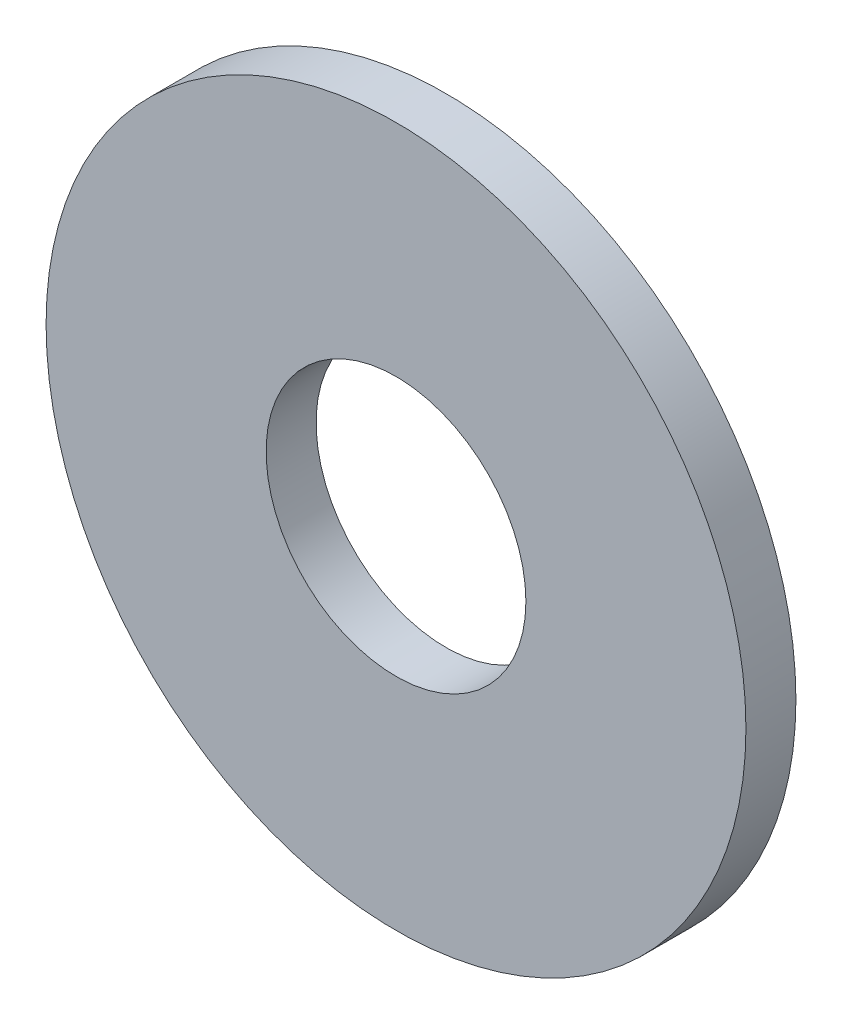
ISO-10303-21;
HEADER;
FILE_DESCRIPTION(('STEP AP214'),'2;1');
FILE_NAME('part.step','',(''),(''),'','','');
FILE_SCHEMA(('AUTOMOTIVE_DESIGN { 1 0 10303 214 1 1 1 1 }'));
ENDSEC;
DATA;
#1=APPLICATION_CONTEXT('core data for automotive mechanical design processes');
#2=APPLICATION_PROTOCOL_DEFINITION('international standard','automotive_design',2000,#1);
#3=PRODUCT_CONTEXT('',#1,'mechanical');
#4=PRODUCT('Part','Part','',(#3));
#5=PRODUCT_RELATED_PRODUCT_CATEGORY('part','',(#4));
#6=PRODUCT_DEFINITION_FORMATION('','',#4);
#7=PRODUCT_DEFINITION_CONTEXT('part definition',#1,'design');
#8=PRODUCT_DEFINITION('design','',#6,#7);
#9=PRODUCT_DEFINITION_SHAPE('','',#8);
#10=(LENGTH_UNIT() NAMED_UNIT(*) SI_UNIT(.MILLI.,.METRE.));
#11=(NAMED_UNIT(*) PLANE_ANGLE_UNIT() SI_UNIT($,.RADIAN.));
#12=(NAMED_UNIT(*) SI_UNIT($,.STERADIAN.) SOLID_ANGLE_UNIT());
#13=UNCERTAINTY_MEASURE_WITH_UNIT(LENGTH_MEASURE(1.E-05),#10,'distance_accuracy_value','');
#14=(GEOMETRIC_REPRESENTATION_CONTEXT(3) GLOBAL_UNCERTAINTY_ASSIGNED_CONTEXT((#13)) GLOBAL_UNIT_ASSIGNED_CONTEXT((#10,
#11,#12)) REPRESENTATION_CONTEXT('',''));
#15=CARTESIAN_POINT('',(0.,0.,0.));
#16=DIRECTION('',(0.,0.,1.));
#17=DIRECTION('',(1.,0.,0.));
#18=AXIS2_PLACEMENT_3D('',#15,#16,#17);
#19=CARTESIAN_POINT('',(195.838255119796,4.20763790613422,1.27));
#20=DIRECTION('',(0.,0.,1.));
#21=DIRECTION('',(1.,0.,0.));
#22=AXIS2_PLACEMENT_3D('',#19,#20,#21);
#23=PLANE('',#22);
#24=CARTESIAN_POINT('',(195.838255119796,4.20763790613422,1.27));
#25=DIRECTION('',(0.,0.,1.));
#26=DIRECTION('',(1.,0.,0.));
#27=AXIS2_PLACEMENT_3D('',#24,#25,#26);
#28=CIRCLE('',#27,8.89000000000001);
#29=CARTESIAN_POINT('',(204.728255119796,4.20763790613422,1.27));
#30=VERTEX_POINT('',#29);
#31=EDGE_CURVE('E10',#30,#30,#28,.T.);
#32=ORIENTED_EDGE('',*,*,#31,.T.);
#33=EDGE_LOOP('',(#32));
#34=FACE_BOUND('',#33,.T.);
#35=CARTESIAN_POINT('',(195.838255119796,4.20763790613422,1.27));
#36=DIRECTION('',(0.,0.,1.));
#37=DIRECTION('',(1.,0.,0.));
#38=AXIS2_PLACEMENT_3D('',#35,#36,#37);
#39=CIRCLE('',#38,3.3);
#40=CARTESIAN_POINT('',(199.138255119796,4.20763790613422,1.27));
#41=VERTEX_POINT('',#40);
#42=EDGE_CURVE('E43',#41,#41,#39,.T.);
#43=ORIENTED_EDGE('',*,*,#42,.F.);
#44=EDGE_LOOP('',(#43));
#45=FACE_BOUND('',#44,.T.);
#46=ADVANCED_FACE('F32',(#34,#45),#23,.T.);
#47=CARTESIAN_POINT('',(195.838255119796,4.20763790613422,0.));
#48=DIRECTION('',(0.,0.,1.));
#49=DIRECTION('',(1.,0.,0.));
#50=AXIS2_PLACEMENT_3D('',#47,#48,#49);
#51=PLANE('',#50);
#52=CARTESIAN_POINT('',(195.838255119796,4.20763790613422,0.));
#53=DIRECTION('',(0.,0.,1.));
#54=DIRECTION('',(1.,0.,0.));
#55=AXIS2_PLACEMENT_3D('',#52,#53,#54);
#56=CIRCLE('',#55,8.89000000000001);
#57=CARTESIAN_POINT('',(204.728255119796,4.20763790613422,0.));
#58=VERTEX_POINT('',#57);
#59=EDGE_CURVE('E36',#58,#58,#56,.T.);
#60=ORIENTED_EDGE('',*,*,#59,.F.);
#61=EDGE_LOOP('',(#60));
#62=FACE_BOUND('',#61,.T.);
#63=CARTESIAN_POINT('',(195.838255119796,4.20763790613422,0.));
#64=DIRECTION('',(0.,0.,1.));
#65=DIRECTION('',(1.,0.,0.));
#66=AXIS2_PLACEMENT_3D('',#63,#64,#65);
#67=CIRCLE('',#66,3.3);
#68=CARTESIAN_POINT('',(199.138255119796,4.20763790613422,0.));
#69=VERTEX_POINT('',#68);
#70=EDGE_CURVE('E45',#69,#69,#67,.T.);
#71=ORIENTED_EDGE('',*,*,#70,.T.);
#72=EDGE_LOOP('',(#71));
#73=FACE_BOUND('',#72,.T.);
#74=ADVANCED_FACE('F55',(#62,#73),#51,.F.);
#75=CARTESIAN_POINT('',(195.838255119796,4.20763790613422,1.27));
#76=DIRECTION('',(0.,0.,-1.));
#77=DIRECTION('',(-1.,0.,0.));
#78=AXIS2_PLACEMENT_3D('',#75,#76,#77);
#79=CYLINDRICAL_SURFACE('',#78,8.89000000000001);
#80=ORIENTED_EDGE('',*,*,#31,.F.);
#81=EDGE_LOOP('',(#80));
#82=FACE_BOUND('',#81,.T.);
#83=ORIENTED_EDGE('',*,*,#59,.T.);
#84=EDGE_LOOP('',(#83));
#85=FACE_BOUND('',#84,.T.);
#86=ADVANCED_FACE('F34',(#82,#85),#79,.T.);
#87=CARTESIAN_POINT('',(195.838255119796,4.20763790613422,1.27));
#88=DIRECTION('',(0.,0.,-1.));
#89=DIRECTION('',(-1.,0.,0.));
#90=AXIS2_PLACEMENT_3D('',#87,#88,#89);
#91=CYLINDRICAL_SURFACE('',#90,3.3);
#92=ORIENTED_EDGE('',*,*,#42,.T.);
#93=EDGE_LOOP('',(#92));
#94=FACE_BOUND('',#93,.T.);
#95=ORIENTED_EDGE('',*,*,#70,.F.);
#96=EDGE_LOOP('',(#95));
#97=FACE_BOUND('',#96,.T.);
#98=ADVANCED_FACE('F51',(#94,#97),#91,.F.);
#99=CLOSED_SHELL('',(#46,#74,#86,#98));
#100=MANIFOLD_SOLID_BREP('B2',#99);
#101=ADVANCED_BREP_SHAPE_REPRESENTATION('',(#18,#100),#14);
#102=SHAPE_DEFINITION_REPRESENTATION(#9,#101);
ENDSEC;
END-ISO-10303-21;
